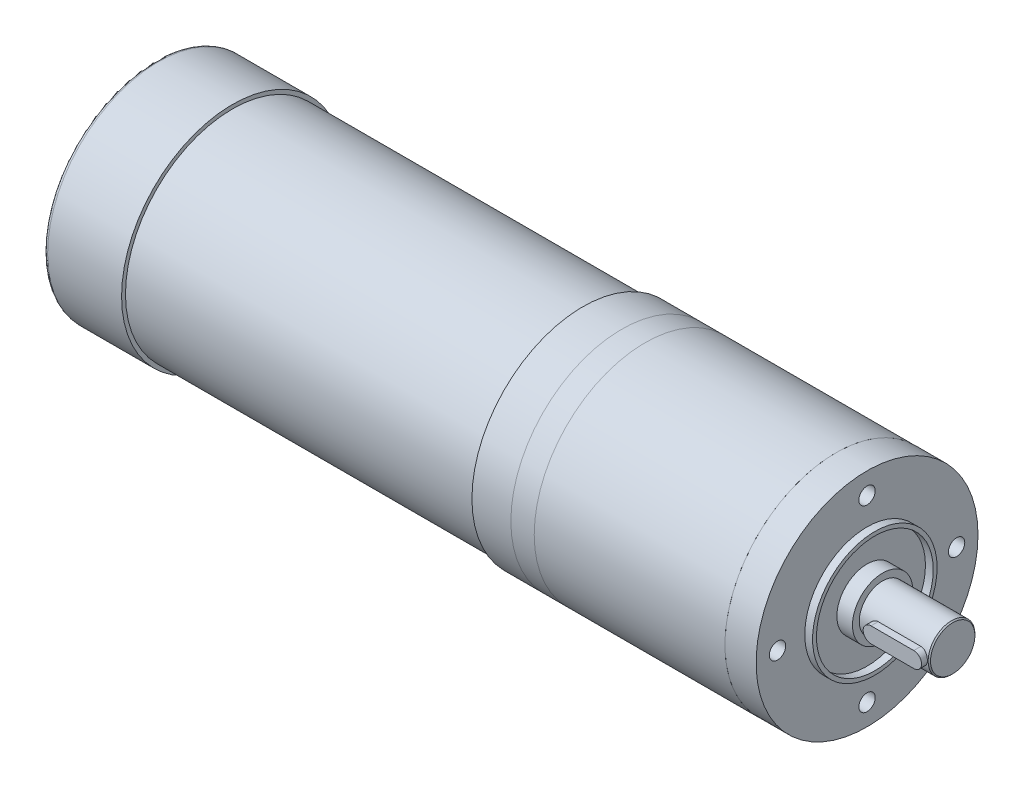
ISO-10303-21;
HEADER;
FILE_DESCRIPTION(('STEP AP214'),'2;1');
FILE_NAME('part.step','',(''),(''),'','','');
FILE_SCHEMA(('AUTOMOTIVE_DESIGN { 1 0 10303 214 1 1 1 1 }'));
ENDSEC;
DATA;
#1=APPLICATION_CONTEXT('core data for automotive mechanical design processes');
#2=APPLICATION_PROTOCOL_DEFINITION('international standard','automotive_design',2000,#1);
#3=PRODUCT_CONTEXT('',#1,'mechanical');
#4=PRODUCT('Part','Part','',(#3));
#5=PRODUCT_RELATED_PRODUCT_CATEGORY('part','',(#4));
#6=PRODUCT_DEFINITION_FORMATION('','',#4);
#7=PRODUCT_DEFINITION_CONTEXT('part definition',#1,'design');
#8=PRODUCT_DEFINITION('design','',#6,#7);
#9=PRODUCT_DEFINITION_SHAPE('','',#8);
#10=(LENGTH_UNIT() NAMED_UNIT(*) SI_UNIT(.MILLI.,.METRE.));
#11=(NAMED_UNIT(*) PLANE_ANGLE_UNIT() SI_UNIT($,.RADIAN.));
#12=(NAMED_UNIT(*) SI_UNIT($,.STERADIAN.) SOLID_ANGLE_UNIT());
#13=UNCERTAINTY_MEASURE_WITH_UNIT(LENGTH_MEASURE(1.E-05),#10,'distance_accuracy_value','');
#14=(GEOMETRIC_REPRESENTATION_CONTEXT(3) GLOBAL_UNCERTAINTY_ASSIGNED_CONTEXT((#13)) GLOBAL_UNIT_ASSIGNED_CONTEXT((#10,
#11,#12)) REPRESENTATION_CONTEXT('',''));
#15=CARTESIAN_POINT('',(0.,0.,0.));
#16=DIRECTION('',(0.,0.,1.));
#17=DIRECTION('',(1.,0.,0.));
#18=AXIS2_PLACEMENT_3D('',#15,#16,#17);
#19=CARTESIAN_POINT('',(8.5,0.,7.5));
#20=DIRECTION('',(0.,0.,-1.));
#21=DIRECTION('',(-1.,0.,0.));
#22=AXIS2_PLACEMENT_3D('',#19,#20,#21);
#23=CYLINDRICAL_SURFACE('',#22,2.);
#24=CARTESIAN_POINT('',(8.5,0.,3.5));
#25=DIRECTION('',(0.,0.,1.));
#26=DIRECTION('',(1.,0.,0.));
#27=AXIS2_PLACEMENT_3D('',#24,#25,#26);
#28=CIRCLE('',#27,2.);
#29=CARTESIAN_POINT('',(8.5,2.,3.5));
#30=VERTEX_POINT('',#29);
#31=CARTESIAN_POINT('',(8.5,-2.,3.5));
#32=VERTEX_POINT('',#31);
#33=EDGE_CURVE('E111',#30,#32,#28,.T.);
#34=ORIENTED_EDGE('',*,*,#33,.T.);
#35=DIRECTION('',(0.,0.,-1.));
#36=VECTOR('',#35,1.);
#37=CARTESIAN_POINT('',(8.5,-2.,7.5));
#38=LINE('',#37,#36);
#39=CARTESIAN_POINT('',(8.5,-2.,7.5));
#40=VERTEX_POINT('',#39);
#41=EDGE_CURVE('E12',#40,#32,#38,.T.);
#42=ORIENTED_EDGE('',*,*,#41,.F.);
#43=CARTESIAN_POINT('',(8.5,0.,7.5));
#44=DIRECTION('',(0.,0.,1.));
#45=DIRECTION('',(1.,0.,0.));
#46=AXIS2_PLACEMENT_3D('',#43,#44,#45);
#47=CIRCLE('',#46,2.);
#48=CARTESIAN_POINT('',(8.5,2.,7.5));
#49=VERTEX_POINT('',#48);
#50=EDGE_CURVE('E99',#49,#40,#47,.T.);
#51=ORIENTED_EDGE('',*,*,#50,.F.);
#52=DIRECTION('',(0.,0.,-1.));
#53=VECTOR('',#52,1.);
#54=CARTESIAN_POINT('',(8.5,2.,7.5));
#55=LINE('',#54,#53);
#56=EDGE_CURVE('E107',#49,#30,#55,.T.);
#57=ORIENTED_EDGE('',*,*,#56,.T.);
#58=EDGE_LOOP('',(#34,#42,#51,#57));
#59=FACE_BOUND('',#58,.T.);
#60=ADVANCED_FACE('F48',(#59),#23,.T.);
#61=CARTESIAN_POINT('',(19.5,-2.,7.5));
#62=DIRECTION('',(0.,1.,0.));
#63=DIRECTION('',(-1.,0.,0.));
#64=AXIS2_PLACEMENT_3D('',#61,#62,#63);
#65=PLANE('',#64);
#66=DIRECTION('',(1.,0.,0.));
#67=VECTOR('',#66,1.);
#68=CARTESIAN_POINT('',(19.5,-2.,3.5));
#69=LINE('',#68,#67);
#70=CARTESIAN_POINT('',(19.5,-2.,3.5));
#71=VERTEX_POINT('',#70);
#72=EDGE_CURVE('E103',#32,#71,#69,.T.);
#73=ORIENTED_EDGE('',*,*,#72,.T.);
#74=DIRECTION('',(0.,0.,-1.));
#75=VECTOR('',#74,1.);
#76=CARTESIAN_POINT('',(19.5,-2.,7.5));
#77=LINE('',#76,#75);
#78=CARTESIAN_POINT('',(19.5,-2.,7.5));
#79=VERTEX_POINT('',#78);
#80=EDGE_CURVE('E56',#79,#71,#77,.T.);
#81=ORIENTED_EDGE('',*,*,#80,.F.);
#82=DIRECTION('',(1.,0.,0.));
#83=VECTOR('',#82,1.);
#84=CARTESIAN_POINT('',(19.5,-2.,7.5));
#85=LINE('',#84,#83);
#86=EDGE_CURVE('E94',#40,#79,#85,.T.);
#87=ORIENTED_EDGE('',*,*,#86,.F.);
#88=ORIENTED_EDGE('',*,*,#41,.T.);
#89=EDGE_LOOP('',(#73,#81,#87,#88));
#90=FACE_BOUND('',#89,.T.);
#91=ADVANCED_FACE('F102',(#90),#65,.F.);
#92=CARTESIAN_POINT('',(19.5,0.,7.5));
#93=DIRECTION('',(0.,0.,-1.));
#94=DIRECTION('',(-1.,0.,0.));
#95=AXIS2_PLACEMENT_3D('',#92,#93,#94);
#96=CYLINDRICAL_SURFACE('',#95,2.);
#97=CARTESIAN_POINT('',(19.5,0.,3.5));
#98=DIRECTION('',(0.,0.,1.));
#99=DIRECTION('',(1.,0.,0.));
#100=AXIS2_PLACEMENT_3D('',#97,#98,#99);
#101=CIRCLE('',#100,2.);
#102=CARTESIAN_POINT('',(19.5,2.,3.5));
#103=VERTEX_POINT('',#102);
#104=EDGE_CURVE('E81',#71,#103,#101,.T.);
#105=ORIENTED_EDGE('',*,*,#104,.T.);
#106=DIRECTION('',(0.,0.,-1.));
#107=VECTOR('',#106,1.);
#108=CARTESIAN_POINT('',(19.5,2.,7.5));
#109=LINE('',#108,#107);
#110=CARTESIAN_POINT('',(19.5,2.,7.5));
#111=VERTEX_POINT('',#110);
#112=EDGE_CURVE('E104',#111,#103,#109,.T.);
#113=ORIENTED_EDGE('',*,*,#112,.F.);
#114=CARTESIAN_POINT('',(19.5,0.,7.5));
#115=DIRECTION('',(0.,0.,1.));
#116=DIRECTION('',(1.,0.,0.));
#117=AXIS2_PLACEMENT_3D('',#114,#115,#116);
#118=CIRCLE('',#117,2.);
#119=EDGE_CURVE('E97',#79,#111,#118,.T.);
#120=ORIENTED_EDGE('',*,*,#119,.F.);
#121=ORIENTED_EDGE('',*,*,#80,.T.);
#122=EDGE_LOOP('',(#105,#113,#120,#121));
#123=FACE_BOUND('',#122,.T.);
#124=ADVANCED_FACE('F105',(#123),#96,.T.);
#125=CARTESIAN_POINT('',(8.5,2.,7.5));
#126=DIRECTION('',(0.,-1.,0.));
#127=DIRECTION('',(1.,0.,0.));
#128=AXIS2_PLACEMENT_3D('',#125,#126,#127);
#129=PLANE('',#128);
#130=DIRECTION('',(-1.,0.,0.));
#131=VECTOR('',#130,1.);
#132=CARTESIAN_POINT('',(8.5,2.,3.5));
#133=LINE('',#132,#131);
#134=EDGE_CURVE('E87',#103,#30,#133,.T.);
#135=ORIENTED_EDGE('',*,*,#134,.T.);
#136=ORIENTED_EDGE('',*,*,#56,.F.);
#137=DIRECTION('',(-1.,0.,0.));
#138=VECTOR('',#137,1.);
#139=CARTESIAN_POINT('',(8.5,2.,7.5));
#140=LINE('',#139,#138);
#141=EDGE_CURVE('E64',#111,#49,#140,.T.);
#142=ORIENTED_EDGE('',*,*,#141,.F.);
#143=ORIENTED_EDGE('',*,*,#112,.T.);
#144=EDGE_LOOP('',(#135,#136,#142,#143));
#145=FACE_BOUND('',#144,.T.);
#146=ADVANCED_FACE('F118',(#145),#129,.F.);
#147=CARTESIAN_POINT('',(8.5,0.,7.5));
#148=DIRECTION('',(0.,0.,1.));
#149=DIRECTION('',(1.,0.,0.));
#150=AXIS2_PLACEMENT_3D('',#147,#148,#149);
#151=PLANE('',#150);
#152=ORIENTED_EDGE('',*,*,#50,.T.);
#153=ORIENTED_EDGE('',*,*,#86,.T.);
#154=ORIENTED_EDGE('',*,*,#119,.T.);
#155=ORIENTED_EDGE('',*,*,#141,.T.);
#156=EDGE_LOOP('',(#152,#153,#154,#155));
#157=FACE_BOUND('',#156,.T.);
#158=ADVANCED_FACE('F95',(#157),#151,.T.);
#159=CARTESIAN_POINT('',(8.5,0.,3.5));
#160=DIRECTION('',(0.,0.,1.));
#161=DIRECTION('',(1.,0.,0.));
#162=AXIS2_PLACEMENT_3D('',#159,#160,#161);
#163=PLANE('',#162);
#164=ORIENTED_EDGE('',*,*,#33,.F.);
#165=ORIENTED_EDGE('',*,*,#134,.F.);
#166=ORIENTED_EDGE('',*,*,#104,.F.);
#167=ORIENTED_EDGE('',*,*,#72,.F.);
#168=EDGE_LOOP('',(#164,#165,#166,#167));
#169=FACE_BOUND('',#168,.T.);
#170=ADVANCED_FACE('F121',(#169),#163,.F.);
#171=CLOSED_SHELL('',(#60,#91,#124,#146,#158,#170));
#172=MANIFOLD_SOLID_BREP('B2',#171);
#173=CARTESIAN_POINT('',(-73.,0.,0.));
#174=DIRECTION('',(-1.,0.,0.));
#175=DIRECTION('',(0.,0.,1.));
#176=AXIS2_PLACEMENT_3D('',#173,#174,#175);
#177=PLANE('',#176);
#178=CARTESIAN_POINT('',(-73.,0.,0.));
#179=DIRECTION('',(-1.,0.,0.));
#180=DIRECTION('',(0.,0.,1.));
#181=AXIS2_PLACEMENT_3D('',#178,#179,#180);
#182=CIRCLE('',#181,28.5);
#183=CARTESIAN_POINT('',(-73.,0.,28.5));
#184=VERTEX_POINT('',#183);
#185=EDGE_CURVE('E191',#184,#184,#182,.T.);
#186=ORIENTED_EDGE('',*,*,#185,.T.);
#187=EDGE_LOOP('',(#186));
#188=FACE_BOUND('',#187,.T.);
#189=CARTESIAN_POINT('',(-73.,0.,0.));
#190=DIRECTION('',(-1.,0.,0.));
#191=DIRECTION('',(0.,0.,1.));
#192=AXIS2_PLACEMENT_3D('',#189,#190,#191);
#193=CIRCLE('',#192,27.5);
#194=CARTESIAN_POINT('',(-73.,0.,-27.5));
#195=VERTEX_POINT('',#194);
#196=EDGE_CURVE('E201',#195,#195,#193,.T.);
#197=ORIENTED_EDGE('',*,*,#196,.F.);
#198=EDGE_LOOP('',(#197));
#199=FACE_BOUND('',#198,.T.);
#200=ADVANCED_FACE('F180',(#188,#199),#177,.T.);
#201=CARTESIAN_POINT('',(-73.,0.,0.));
#202=DIRECTION('',(1.,0.,0.));
#203=DIRECTION('',(0.,0.,-1.));
#204=AXIS2_PLACEMENT_3D('',#201,#202,#203);
#205=CYLINDRICAL_SURFACE('',#204,28.5);
#206=ORIENTED_EDGE('',*,*,#185,.F.);
#207=EDGE_LOOP('',(#206));
#208=FACE_BOUND('',#207,.T.);
#209=CARTESIAN_POINT('',(-63.,0.,0.));
#210=DIRECTION('',(-1.,0.,0.));
#211=DIRECTION('',(0.,0.,1.));
#212=AXIS2_PLACEMENT_3D('',#209,#210,#211);
#213=CIRCLE('',#212,28.5);
#214=CARTESIAN_POINT('',(-63.,0.,28.5));
#215=VERTEX_POINT('',#214);
#216=EDGE_CURVE('E195',#215,#215,#213,.T.);
#217=ORIENTED_EDGE('',*,*,#216,.T.);
#218=EDGE_LOOP('',(#217));
#219=FACE_BOUND('',#218,.T.);
#220=ADVANCED_FACE('F226',(#208,#219),#205,.T.);
#221=CARTESIAN_POINT('',(-63.,0.,0.));
#222=DIRECTION('',(-1.,0.,0.));
#223=DIRECTION('',(0.,0.,1.));
#224=AXIS2_PLACEMENT_3D('',#221,#222,#223);
#225=PLANE('',#224);
#226=ORIENTED_EDGE('',*,*,#216,.F.);
#227=EDGE_LOOP('',(#226));
#228=FACE_BOUND('',#227,.T.);
#229=ADVANCED_FACE('F221',(#228),#225,.F.);
#230=CARTESIAN_POINT('',(-163.,0.,0.));
#231=DIRECTION('',(1.,0.,0.));
#232=DIRECTION('',(0.,0.,-1.));
#233=AXIS2_PLACEMENT_3D('',#230,#231,#232);
#234=CYLINDRICAL_SURFACE('',#233,27.5);
#235=CARTESIAN_POINT('',(-163.,0.,0.));
#236=DIRECTION('',(-1.,0.,0.));
#237=DIRECTION('',(0.,0.,1.));
#238=AXIS2_PLACEMENT_3D('',#235,#236,#237);
#239=CIRCLE('',#238,27.5);
#240=CARTESIAN_POINT('',(-163.,0.,-27.5));
#241=VERTEX_POINT('',#240);
#242=EDGE_CURVE('E199',#241,#241,#239,.T.);
#243=CARTESIAN_POINT('',(-163.,0.,-27.5));
#244=CARTESIAN_POINT('',(-162.0625,0.,-27.5));
#245=CARTESIAN_POINT('',(-161.125,0.,-27.5));
#246=CARTESIAN_POINT('',(-159.25,0.,-27.5));
#247=CARTESIAN_POINT('',(-158.3125,0.,-27.5));
#248=CARTESIAN_POINT('',(-156.4375,0.,-27.5));
#249=CARTESIAN_POINT('',(-155.5,0.,-27.5));
#250=CARTESIAN_POINT('',(-153.625,0.,-27.5));
#251=CARTESIAN_POINT('',(-152.6875,0.,-27.5));
#252=CARTESIAN_POINT('',(-150.8125,0.,-27.5));
#253=CARTESIAN_POINT('',(-149.875,0.,-27.5));
#254=CARTESIAN_POINT('',(-148.,0.,-27.5));
#255=CARTESIAN_POINT('',(-147.0625,0.,-27.5));
#256=CARTESIAN_POINT('',(-145.1875,0.,-27.5));
#257=CARTESIAN_POINT('',(-144.25,0.,-27.5));
#258=CARTESIAN_POINT('',(-142.375,0.,-27.5));
#259=CARTESIAN_POINT('',(-141.4375,0.,-27.5));
#260=CARTESIAN_POINT('',(-139.5625,0.,-27.5));
#261=CARTESIAN_POINT('',(-138.625,0.,-27.5));
#262=CARTESIAN_POINT('',(-136.75,0.,-27.5));
#263=CARTESIAN_POINT('',(-135.8125,0.,-27.5));
#264=CARTESIAN_POINT('',(-133.9375,0.,-27.5));
#265=CARTESIAN_POINT('',(-133.,0.,-27.5));
#266=CARTESIAN_POINT('',(-131.125,0.,-27.5));
#267=CARTESIAN_POINT('',(-130.1875,0.,-27.5));
#268=CARTESIAN_POINT('',(-128.3125,0.,-27.5));
#269=CARTESIAN_POINT('',(-127.375,0.,-27.5));
#270=CARTESIAN_POINT('',(-125.5,0.,-27.5));
#271=CARTESIAN_POINT('',(-124.5625,0.,-27.5));
#272=CARTESIAN_POINT('',(-122.6875,0.,-27.5));
#273=CARTESIAN_POINT('',(-121.75,0.,-27.5));
#274=CARTESIAN_POINT('',(-119.875,0.,-27.5));
#275=CARTESIAN_POINT('',(-118.9375,0.,-27.5));
#276=CARTESIAN_POINT('',(-117.0625,0.,-27.5));
#277=CARTESIAN_POINT('',(-116.125,0.,-27.5));
#278=CARTESIAN_POINT('',(-114.25,0.,-27.5));
#279=CARTESIAN_POINT('',(-113.3125,0.,-27.5));
#280=CARTESIAN_POINT('',(-111.4375,0.,-27.5));
#281=CARTESIAN_POINT('',(-110.5,0.,-27.5));
#282=CARTESIAN_POINT('',(-108.625,0.,-27.5));
#283=CARTESIAN_POINT('',(-107.6875,0.,-27.5));
#284=CARTESIAN_POINT('',(-105.8125,0.,-27.5));
#285=CARTESIAN_POINT('',(-104.875,0.,-27.5));
#286=CARTESIAN_POINT('',(-103.,0.,-27.5));
#287=CARTESIAN_POINT('',(-102.0625,0.,-27.5));
#288=CARTESIAN_POINT('',(-100.1875,0.,-27.5));
#289=CARTESIAN_POINT('',(-99.25,0.,-27.5));
#290=CARTESIAN_POINT('',(-97.375,0.,-27.5));
#291=CARTESIAN_POINT('',(-96.4375,0.,-27.5));
#292=CARTESIAN_POINT('',(-94.5625,0.,-27.5));
#293=CARTESIAN_POINT('',(-93.625,0.,-27.5));
#294=CARTESIAN_POINT('',(-91.75,0.,-27.5));
#295=CARTESIAN_POINT('',(-90.8125,0.,-27.5));
#296=CARTESIAN_POINT('',(-88.9375,0.,-27.5));
#297=CARTESIAN_POINT('',(-88.,0.,-27.5));
#298=CARTESIAN_POINT('',(-86.125,0.,-27.5));
#299=CARTESIAN_POINT('',(-85.1875,0.,-27.5));
#300=CARTESIAN_POINT('',(-83.3125,0.,-27.5));
#301=CARTESIAN_POINT('',(-82.375,0.,-27.5));
#302=CARTESIAN_POINT('',(-80.5,0.,-27.5));
#303=CARTESIAN_POINT('',(-79.5625,0.,-27.5));
#304=CARTESIAN_POINT('',(-77.6875,0.,-27.5));
#305=CARTESIAN_POINT('',(-76.75,0.,-27.5));
#306=CARTESIAN_POINT('',(-74.875,0.,-27.5));
#307=CARTESIAN_POINT('',(-73.9375,0.,-27.5));
#308=CARTESIAN_POINT('',(-73.,0.,-27.5));
#309=B_SPLINE_CURVE_WITH_KNOTS('',3,(#243,#244,#245,#246,#247,#248,#249,#250,#251,#252,#253,
#254,#255,#256,#257,#258,#259,#260,#261,#262,#263,#264,#265,#266,#267,#268,#269,#270,#271,#272,
#273,#274,#275,#276,#277,#278,#279,#280,#281,#282,#283,#284,#285,#286,#287,#288,#289,#290,#291,
#292,#293,#294,#295,#296,#297,#298,#299,#300,#301,#302,#303,#304,#305,#306,#307,#308),
.UNSPECIFIED.,.F.,.F.,(4,2,2,2,2,2,2,2,2,2,2,2,2,2,2,2,2,2,2,2,2,2,2,2,2,2,2,2,2,2,2,2,4),(0.,
2.8125,5.62499999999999,8.43749999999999,11.25,14.0625,16.875,19.6875,22.5,25.3125,28.125,
30.9375,33.75,36.5625,39.375,42.1875,45.,47.8125,50.625,53.4375,56.25,59.0625,61.875,64.6875,
67.5,70.3125,73.125,75.9375,78.75,81.5625,84.3749999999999,87.1875,90.),.UNSPECIFIED.);
#310=EDGE_CURVE('BSEAM215',#241,#195,#309,.T.);
#311=ORIENTED_EDGE('',*,*,#242,.F.);
#312=ORIENTED_EDGE('',*,*,#196,.T.);
#313=ORIENTED_EDGE('',*,*,#310,.T.);
#314=ORIENTED_EDGE('',*,*,#310,.F.);
#315=EDGE_LOOP('',(#311,#313,#312,#314));
#316=FACE_BOUND('',#315,.T.);
#317=ADVANCED_FACE('F215',(#316),#234,.T.);
#318=CARTESIAN_POINT('',(-163.,0.,0.));
#319=DIRECTION('',(-1.,0.,0.));
#320=DIRECTION('',(0.,0.,1.));
#321=AXIS2_PLACEMENT_3D('',#318,#319,#320);
#322=PLANE('',#321);
#323=CARTESIAN_POINT('',(-163.,0.,0.));
#324=DIRECTION('',(-1.,0.,0.));
#325=DIRECTION('',(0.,0.,1.));
#326=AXIS2_PLACEMENT_3D('',#323,#324,#325);
#327=CIRCLE('',#326,28.5);
#328=CARTESIAN_POINT('',(-163.,0.,28.5));
#329=VERTEX_POINT('',#328);
#330=EDGE_CURVE('E204',#329,#329,#327,.T.);
#331=ORIENTED_EDGE('',*,*,#330,.F.);
#332=EDGE_LOOP('',(#331));
#333=FACE_BOUND('',#332,.T.);
#334=ORIENTED_EDGE('',*,*,#242,.T.);
#335=EDGE_LOOP('',(#334));
#336=FACE_BOUND('',#335,.T.);
#337=ADVANCED_FACE('F212',(#333,#336),#322,.F.);
#338=CARTESIAN_POINT('',(-183.,0.,0.));
#339=DIRECTION('',(1.,0.,0.));
#340=DIRECTION('',(0.,0.,-1.));
#341=AXIS2_PLACEMENT_3D('',#338,#339,#340);
#342=CYLINDRICAL_SURFACE('',#341,28.5);
#343=CARTESIAN_POINT('',(-182.,0.,0.));
#344=DIRECTION('',(-1.,0.,0.));
#345=DIRECTION('',(0.,0.,1.));
#346=AXIS2_PLACEMENT_3D('',#343,#344,#345);
#347=CIRCLE('',#346,28.5);
#348=CARTESIAN_POINT('',(-182.,0.,28.5));
#349=VERTEX_POINT('',#348);
#350=EDGE_CURVE('E47',#349,#349,#347,.F.);
#351=ORIENTED_EDGE('',*,*,#350,.T.);
#352=EDGE_LOOP('',(#351));
#353=FACE_BOUND('',#352,.T.);
#354=ORIENTED_EDGE('',*,*,#330,.T.);
#355=EDGE_LOOP('',(#354));
#356=FACE_BOUND('',#355,.T.);
#357=ADVANCED_FACE('F210',(#353,#356),#342,.T.);
#358=CARTESIAN_POINT('',(-183.,0.,0.));
#359=DIRECTION('',(-1.,0.,0.));
#360=DIRECTION('',(0.,0.,1.));
#361=AXIS2_PLACEMENT_3D('',#358,#359,#360);
#362=PLANE('',#361);
#363=CARTESIAN_POINT('',(-183.,0.,0.));
#364=DIRECTION('',(-1.,0.,0.));
#365=DIRECTION('',(0.,0.,1.));
#366=AXIS2_PLACEMENT_3D('',#363,#364,#365);
#367=CIRCLE('',#366,27.5);
#368=CARTESIAN_POINT('',(-183.,0.,27.5));
#369=VERTEX_POINT('',#368);
#370=EDGE_CURVE('E187',#369,#369,#367,.T.);
#371=ORIENTED_EDGE('',*,*,#370,.T.);
#372=EDGE_LOOP('',(#371));
#373=FACE_BOUND('',#372,.T.);
#374=ADVANCED_FACE('F257',(#373),#362,.T.);
#375=CARTESIAN_POINT('',(-182.,0.,0.));
#376=DIRECTION('',(-1.,0.,0.));
#377=DIRECTION('',(0.,0.,1.));
#378=AXIS2_PLACEMENT_3D('',#375,#376,#377);
#379=TOROIDAL_SURFACE('',#378,27.5,1.);
#380=ORIENTED_EDGE('',*,*,#350,.F.);
#381=EDGE_LOOP('',(#380));
#382=FACE_BOUND('',#381,.T.);
#383=ORIENTED_EDGE('',*,*,#370,.F.);
#384=EDGE_LOOP('',(#383));
#385=FACE_BOUND('',#384,.T.);
#386=ADVANCED_FACE('F182',(#382,#385),#379,.T.);
#387=CLOSED_SHELL('',(#200,#220,#229,#317,#337,#357,#374,#386));
#388=MANIFOLD_SOLID_BREP('B6',#387);
#389=CARTESIAN_POINT('',(-63.,0.,0.));
#390=DIRECTION('',(1.,0.,0.));
#391=DIRECTION('',(0.,0.,-1.));
#392=AXIS2_PLACEMENT_3D('',#389,#390,#391);
#393=CYLINDRICAL_SURFACE('',#392,28.5);
#394=CARTESIAN_POINT('',(-63.,0.,0.));
#395=DIRECTION('',(-1.,0.,0.));
#396=DIRECTION('',(0.,0.,1.));
#397=AXIS2_PLACEMENT_3D('',#394,#395,#396);
#398=CIRCLE('',#397,28.5);
#399=CARTESIAN_POINT('',(-63.,0.,28.5));
#400=VERTEX_POINT('',#399);
#401=EDGE_CURVE('E179',#400,#400,#398,.T.);
#402=ORIENTED_EDGE('',*,*,#401,.F.);
#403=EDGE_LOOP('',(#402));
#404=FACE_BOUND('',#403,.T.);
#405=CARTESIAN_POINT('',(-57.,0.,0.));
#406=DIRECTION('',(-1.,0.,0.));
#407=DIRECTION('',(0.,0.,1.));
#408=AXIS2_PLACEMENT_3D('',#405,#406,#407);
#409=CIRCLE('',#408,28.5);
#410=CARTESIAN_POINT('',(-57.,0.,28.5));
#411=VERTEX_POINT('',#410);
#412=EDGE_CURVE('E309',#411,#411,#409,.T.);
#413=ORIENTED_EDGE('',*,*,#412,.T.);
#414=EDGE_LOOP('',(#413));
#415=FACE_BOUND('',#414,.T.);
#416=ADVANCED_FACE('F306',(#404,#415),#393,.T.);
#417=CARTESIAN_POINT('',(-63.,0.,0.));
#418=DIRECTION('',(-1.,0.,0.));
#419=DIRECTION('',(0.,0.,1.));
#420=AXIS2_PLACEMENT_3D('',#417,#418,#419);
#421=PLANE('',#420);
#422=ORIENTED_EDGE('',*,*,#401,.T.);
#423=EDGE_LOOP('',(#422));
#424=FACE_BOUND('',#423,.T.);
#425=ADVANCED_FACE('F321',(#424),#421,.T.);
#426=CARTESIAN_POINT('',(-57.,0.,0.));
#427=DIRECTION('',(-1.,0.,0.));
#428=DIRECTION('',(0.,0.,1.));
#429=AXIS2_PLACEMENT_3D('',#426,#427,#428);
#430=PLANE('',#429);
#431=ORIENTED_EDGE('',*,*,#412,.F.);
#432=EDGE_LOOP('',(#431));
#433=FACE_BOUND('',#432,.T.);
#434=ADVANCED_FACE('F319',(#433),#430,.F.);
#435=CLOSED_SHELL('',(#416,#425,#434));
#436=MANIFOLD_SOLID_BREP('B42',#435);
#437=CARTESIAN_POINT('',(-57.,0.,0.));
#438=DIRECTION('',(1.,0.,0.));
#439=DIRECTION('',(0.,0.,-1.));
#440=AXIS2_PLACEMENT_3D('',#437,#438,#439);
#441=CYLINDRICAL_SURFACE('',#440,28.5);
#442=CARTESIAN_POINT('',(-57.,0.,0.));
#443=DIRECTION('',(-1.,0.,0.));
#444=DIRECTION('',(0.,0.,1.));
#445=AXIS2_PLACEMENT_3D('',#442,#443,#444);
#446=CIRCLE('',#445,28.5);
#447=CARTESIAN_POINT('',(-57.,0.,28.5));
#448=VERTEX_POINT('',#447);
#449=EDGE_CURVE('E304',#448,#448,#446,.T.);
#450=ORIENTED_EDGE('',*,*,#449,.F.);
#451=EDGE_LOOP('',(#450));
#452=FACE_BOUND('',#451,.T.);
#453=CARTESIAN_POINT('',(-8.,0.,0.));
#454=DIRECTION('',(-1.,0.,0.));
#455=DIRECTION('',(0.,0.,1.));
#456=AXIS2_PLACEMENT_3D('',#453,#454,#455);
#457=CIRCLE('',#456,28.5);
#458=CARTESIAN_POINT('',(-8.,0.,28.5));
#459=VERTEX_POINT('',#458);
#460=EDGE_CURVE('E364',#459,#459,#457,.T.);
#461=ORIENTED_EDGE('',*,*,#460,.T.);
#462=EDGE_LOOP('',(#461));
#463=FACE_BOUND('',#462,.T.);
#464=ADVANCED_FACE('F356',(#452,#463),#441,.T.);
#465=CARTESIAN_POINT('',(-57.,0.,0.));
#466=DIRECTION('',(-1.,0.,0.));
#467=DIRECTION('',(0.,0.,1.));
#468=AXIS2_PLACEMENT_3D('',#465,#466,#467);
#469=PLANE('',#468);
#470=ORIENTED_EDGE('',*,*,#449,.T.);
#471=EDGE_LOOP('',(#470));
#472=FACE_BOUND('',#471,.T.);
#473=ADVANCED_FACE('F429',(#472),#469,.T.);
#474=CARTESIAN_POINT('',(-8.,0.,0.));
#475=DIRECTION('',(-1.,0.,0.));
#476=DIRECTION('',(0.,0.,1.));
#477=AXIS2_PLACEMENT_3D('',#474,#475,#476);
#478=PLANE('',#477);
#479=CARTESIAN_POINT('',(-8.,23.,0.));
#480=DIRECTION('',(-1.,0.,0.));
#481=DIRECTION('',(0.,0.,1.));
#482=AXIS2_PLACEMENT_3D('',#479,#480,#481);
#483=CIRCLE('',#482,2.1);
#484=CARTESIAN_POINT('',(-8.,23.,2.1));
#485=VERTEX_POINT('',#484);
#486=EDGE_CURVE('E359',#485,#485,#483,.T.);
#487=ORIENTED_EDGE('',*,*,#486,.T.);
#488=EDGE_LOOP('',(#487));
#489=FACE_BOUND('',#488,.T.);
#490=CARTESIAN_POINT('',(-8.,0.,-23.));
#491=DIRECTION('',(-1.,0.,0.));
#492=DIRECTION('',(0.,0.,1.));
#493=AXIS2_PLACEMENT_3D('',#490,#491,#492);
#494=CIRCLE('',#493,2.1);
#495=CARTESIAN_POINT('',(-8.,0.,-20.9));
#496=VERTEX_POINT('',#495);
#497=EDGE_CURVE('E393',#496,#496,#494,.T.);
#498=ORIENTED_EDGE('',*,*,#497,.T.);
#499=EDGE_LOOP('',(#498));
#500=FACE_BOUND('',#499,.T.);
#501=CARTESIAN_POINT('',(-8.,-23.,0.));
#502=DIRECTION('',(-1.,0.,0.));
#503=DIRECTION('',(0.,0.,1.));
#504=AXIS2_PLACEMENT_3D('',#501,#502,#503);
#505=CIRCLE('',#504,2.1);
#506=CARTESIAN_POINT('',(-8.,-23.,2.1));
#507=VERTEX_POINT('',#506);
#508=EDGE_CURVE('E397',#507,#507,#505,.T.);
#509=ORIENTED_EDGE('',*,*,#508,.T.);
#510=EDGE_LOOP('',(#509));
#511=FACE_BOUND('',#510,.T.);
#512=CARTESIAN_POINT('',(-8.,0.,23.));
#513=DIRECTION('',(-1.,0.,0.));
#514=DIRECTION('',(0.,0.,1.));
#515=AXIS2_PLACEMENT_3D('',#512,#513,#514);
#516=CIRCLE('',#515,2.1);
#517=CARTESIAN_POINT('',(-8.,0.,25.1));
#518=VERTEX_POINT('',#517);
#519=EDGE_CURVE('E400',#518,#518,#516,.T.);
#520=ORIENTED_EDGE('',*,*,#519,.T.);
#521=EDGE_LOOP('',(#520));
#522=FACE_BOUND('',#521,.T.);
#523=ORIENTED_EDGE('',*,*,#460,.F.);
#524=EDGE_LOOP('',(#523));
#525=FACE_BOUND('',#524,.T.);
#526=ADVANCED_FACE('F410',(#489,#500,#511,#522,#525),#478,.F.);
#527=CARTESIAN_POINT('',(0.,0.,23.));
#528=DIRECTION('',(1.,0.,0.));
#529=DIRECTION('',(0.,0.,-1.));
#530=AXIS2_PLACEMENT_3D('',#527,#528,#529);
#531=CYLINDRICAL_SURFACE('',#530,2.1);
#532=CARTESIAN_POINT('',(-14.,0.,23.));
#533=DIRECTION('',(1.,0.,0.));
#534=DIRECTION('',(0.,0.,-1.));
#535=AXIS2_PLACEMENT_3D('',#532,#533,#534);
#536=CIRCLE('',#535,2.1);
#537=CARTESIAN_POINT('',(-14.,0.,20.9));
#538=VERTEX_POINT('',#537);
#539=EDGE_CURVE('E398',#538,#538,#536,.T.);
#540=ORIENTED_EDGE('',*,*,#539,.F.);
#541=EDGE_LOOP('',(#540));
#542=FACE_BOUND('',#541,.T.);
#543=ORIENTED_EDGE('',*,*,#519,.F.);
#544=EDGE_LOOP('',(#543));
#545=FACE_BOUND('',#544,.T.);
#546=ADVANCED_FACE('F441',(#542,#545),#531,.F.);
#547=CARTESIAN_POINT('',(-14.,0.,23.));
#548=DIRECTION('',(1.,0.,0.));
#549=DIRECTION('',(0.,0.,-1.));
#550=AXIS2_PLACEMENT_3D('',#547,#548,#549);
#551=CONICAL_SURFACE('',#550,2.1,1.02974425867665);
#552=CARTESIAN_POINT('',(-15.2618072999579,0.,23.));
#553=VERTEX_POINT('',#552);
#554=VERTEX_LOOP('',#553);
#555=FACE_BOUND('',#554,.T.);
#556=ORIENTED_EDGE('',*,*,#539,.T.);
#557=EDGE_LOOP('',(#556));
#558=FACE_BOUND('',#557,.T.);
#559=ADVANCED_FACE('F446',(#555,#558),#551,.F.);
#560=CARTESIAN_POINT('',(0.,-23.,0.));
#561=DIRECTION('',(1.,0.,0.));
#562=DIRECTION('',(0.,0.,-1.));
#563=AXIS2_PLACEMENT_3D('',#560,#561,#562);
#564=CYLINDRICAL_SURFACE('',#563,2.1);
#565=CARTESIAN_POINT('',(-14.,-23.,0.));
#566=DIRECTION('',(1.,0.,0.));
#567=DIRECTION('',(0.,0.,-1.));
#568=AXIS2_PLACEMENT_3D('',#565,#566,#567);
#569=CIRCLE('',#568,2.1);
#570=CARTESIAN_POINT('',(-14.,-23.,-2.1));
#571=VERTEX_POINT('',#570);
#572=EDGE_CURVE('E394',#571,#571,#569,.T.);
#573=ORIENTED_EDGE('',*,*,#572,.F.);
#574=EDGE_LOOP('',(#573));
#575=FACE_BOUND('',#574,.T.);
#576=ORIENTED_EDGE('',*,*,#508,.F.);
#577=EDGE_LOOP('',(#576));
#578=FACE_BOUND('',#577,.T.);
#579=ADVANCED_FACE('F425',(#575,#578),#564,.F.);
#580=CARTESIAN_POINT('',(-14.,-23.,0.));
#581=DIRECTION('',(1.,0.,0.));
#582=DIRECTION('',(0.,0.,-1.));
#583=AXIS2_PLACEMENT_3D('',#580,#581,#582);
#584=CONICAL_SURFACE('',#583,2.1,1.02974425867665);
#585=CARTESIAN_POINT('',(-15.2618072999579,-23.,0.));
#586=VERTEX_POINT('',#585);
#587=VERTEX_LOOP('',#586);
#588=FACE_BOUND('',#587,.T.);
#589=ORIENTED_EDGE('',*,*,#572,.T.);
#590=EDGE_LOOP('',(#589));
#591=FACE_BOUND('',#590,.T.);
#592=ADVANCED_FACE('F416',(#588,#591),#584,.F.);
#593=CARTESIAN_POINT('',(0.,0.,-23.));
#594=DIRECTION('',(1.,0.,0.));
#595=DIRECTION('',(0.,0.,-1.));
#596=AXIS2_PLACEMENT_3D('',#593,#594,#595);
#597=CYLINDRICAL_SURFACE('',#596,2.1);
#598=CARTESIAN_POINT('',(-14.,0.,-23.));
#599=DIRECTION('',(1.,0.,0.));
#600=DIRECTION('',(0.,0.,-1.));
#601=AXIS2_PLACEMENT_3D('',#598,#599,#600);
#602=CIRCLE('',#601,2.1);
#603=CARTESIAN_POINT('',(-14.,0.,-25.1));
#604=VERTEX_POINT('',#603);
#605=EDGE_CURVE('E389',#604,#604,#602,.T.);
#606=ORIENTED_EDGE('',*,*,#605,.F.);
#607=EDGE_LOOP('',(#606));
#608=FACE_BOUND('',#607,.T.);
#609=ORIENTED_EDGE('',*,*,#497,.F.);
#610=EDGE_LOOP('',(#609));
#611=FACE_BOUND('',#610,.T.);
#612=ADVANCED_FACE('F413',(#608,#611),#597,.F.);
#613=CARTESIAN_POINT('',(-14.,0.,-23.));
#614=DIRECTION('',(1.,0.,0.));
#615=DIRECTION('',(0.,0.,-1.));
#616=AXIS2_PLACEMENT_3D('',#613,#614,#615);
#617=CONICAL_SURFACE('',#616,2.1,1.02974425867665);
#618=CARTESIAN_POINT('',(-15.2618072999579,0.,-23.));
#619=VERTEX_POINT('',#618);
#620=VERTEX_LOOP('',#619);
#621=FACE_BOUND('',#620,.T.);
#622=ORIENTED_EDGE('',*,*,#605,.T.);
#623=EDGE_LOOP('',(#622));
#624=FACE_BOUND('',#623,.T.);
#625=ADVANCED_FACE('F415',(#621,#624),#617,.F.);
#626=CARTESIAN_POINT('',(0.,23.,0.));
#627=DIRECTION('',(1.,0.,0.));
#628=DIRECTION('',(0.,0.,-1.));
#629=AXIS2_PLACEMENT_3D('',#626,#627,#628);
#630=CYLINDRICAL_SURFACE('',#629,2.1);
#631=CARTESIAN_POINT('',(-14.,23.,0.));
#632=DIRECTION('',(1.,0.,0.));
#633=DIRECTION('',(0.,0.,-1.));
#634=AXIS2_PLACEMENT_3D('',#631,#632,#633);
#635=CIRCLE('',#634,2.1);
#636=CARTESIAN_POINT('',(-14.,23.,-2.1));
#637=VERTEX_POINT('',#636);
#638=EDGE_CURVE('E385',#637,#637,#635,.T.);
#639=ORIENTED_EDGE('',*,*,#638,.F.);
#640=EDGE_LOOP('',(#639));
#641=FACE_BOUND('',#640,.T.);
#642=ORIENTED_EDGE('',*,*,#486,.F.);
#643=EDGE_LOOP('',(#642));
#644=FACE_BOUND('',#643,.T.);
#645=ADVANCED_FACE('F381',(#641,#644),#630,.F.);
#646=CARTESIAN_POINT('',(-14.,23.,0.));
#647=DIRECTION('',(1.,0.,0.));
#648=DIRECTION('',(0.,0.,-1.));
#649=AXIS2_PLACEMENT_3D('',#646,#647,#648);
#650=CONICAL_SURFACE('',#649,2.1,1.02974425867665);
#651=CARTESIAN_POINT('',(-15.2618072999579,23.,0.));
#652=VERTEX_POINT('',#651);
#653=VERTEX_LOOP('',#652);
#654=FACE_BOUND('',#653,.T.);
#655=ORIENTED_EDGE('',*,*,#638,.T.);
#656=EDGE_LOOP('',(#655));
#657=FACE_BOUND('',#656,.T.);
#658=ADVANCED_FACE('F378',(#654,#657),#650,.F.);
#659=CLOSED_SHELL('',(#464,#473,#526,#546,#559,#579,#592,#612,#625,#645,#658));
#660=MANIFOLD_SOLID_BREP('B174',#659);
#661=CARTESIAN_POINT('',(4.,0.,0.));
#662=DIRECTION('',(1.,0.,0.));
#663=DIRECTION('',(0.,0.,-1.));
#664=AXIS2_PLACEMENT_3D('',#661,#662,#663);
#665=PLANE('',#664);
#666=CARTESIAN_POINT('',(4.,0.,0.));
#667=DIRECTION('',(1.,0.,0.));
#668=DIRECTION('',(0.,0.,-1.));
#669=AXIS2_PLACEMENT_3D('',#666,#667,#668);
#670=CIRCLE('',#669,7.75);
#671=CARTESIAN_POINT('',(4.,0.,-7.75));
#672=VERTEX_POINT('',#671);
#673=EDGE_CURVE('E638',#672,#672,#670,.T.);
#674=ORIENTED_EDGE('',*,*,#673,.T.);
#675=EDGE_LOOP('',(#674));
#676=FACE_BOUND('',#675,.T.);
#677=CARTESIAN_POINT('',(4.,0.,0.));
#678=DIRECTION('',(1.,0.,0.));
#679=DIRECTION('',(0.,0.,-1.));
#680=AXIS2_PLACEMENT_3D('',#677,#678,#679);
#681=CIRCLE('',#680,6.);
#682=CARTESIAN_POINT('',(4.,0.,-6.));
#683=VERTEX_POINT('',#682);
#684=EDGE_CURVE('E634',#683,#683,#681,.T.);
#685=ORIENTED_EDGE('',*,*,#684,.F.);
#686=EDGE_LOOP('',(#685));
#687=FACE_BOUND('',#686,.T.);
#688=ADVANCED_FACE('F547',(#676,#687),#665,.T.);
#689=CARTESIAN_POINT('',(0.,0.,0.));
#690=DIRECTION('',(1.,0.,0.));
#691=DIRECTION('',(0.,0.,-1.));
#692=AXIS2_PLACEMENT_3D('',#689,#690,#691);
#693=PLANE('',#692);
#694=CARTESIAN_POINT('',(0.,0.,0.));
#695=DIRECTION('',(1.,0.,0.));
#696=DIRECTION('',(0.,0.,-1.));
#697=AXIS2_PLACEMENT_3D('',#694,#695,#696);
#698=CIRCLE('',#697,15.);
#699=CARTESIAN_POINT('',(0.,0.,-15.));
#700=VERTEX_POINT('',#699);
#701=EDGE_CURVE('E656',#700,#700,#698,.F.);
#702=ORIENTED_EDGE('',*,*,#701,.F.);
#703=EDGE_LOOP('',(#702));
#704=FACE_BOUND('',#703,.T.);
#705=CARTESIAN_POINT('',(0.,0.,0.));
#706=DIRECTION('',(1.,0.,0.));
#707=DIRECTION('',(0.,0.,-1.));
#708=AXIS2_PLACEMENT_3D('',#705,#706,#707);
#709=CIRCLE('',#708,7.75);
#710=CARTESIAN_POINT('',(0.,0.,-7.75));
#711=VERTEX_POINT('',#710);
#712=EDGE_CURVE('E637',#711,#711,#709,.T.);
#713=ORIENTED_EDGE('',*,*,#712,.F.);
#714=EDGE_LOOP('',(#713));
#715=FACE_BOUND('',#714,.T.);
#716=ADVANCED_FACE('F723',(#704,#715),#693,.T.);
#717=CARTESIAN_POINT('',(0.,23.,0.));
#718=DIRECTION('',(1.,0.,0.));
#719=DIRECTION('',(0.,0.,-1.));
#720=AXIS2_PLACEMENT_3D('',#717,#718,#719);
#721=CIRCLE('',#720,2.1);
#722=CARTESIAN_POINT('',(0.,23.,-2.1));
#723=VERTEX_POINT('',#722);
#724=EDGE_CURVE('E615',#723,#723,#721,.T.);
#725=ORIENTED_EDGE('',*,*,#724,.F.);
#726=EDGE_LOOP('',(#725));
#727=FACE_BOUND('',#726,.T.);
#728=CARTESIAN_POINT('',(0.,0.,-23.));
#729=DIRECTION('',(1.,0.,0.));
#730=DIRECTION('',(0.,0.,-1.));
#731=AXIS2_PLACEMENT_3D('',#728,#729,#730);
#732=CIRCLE('',#731,2.1);
#733=CARTESIAN_POINT('',(0.,0.,-25.1));
#734=VERTEX_POINT('',#733);
#735=EDGE_CURVE('E622',#734,#734,#732,.T.);
#736=ORIENTED_EDGE('',*,*,#735,.F.);
#737=EDGE_LOOP('',(#736));
#738=FACE_BOUND('',#737,.T.);
#739=CARTESIAN_POINT('',(0.,-23.,0.));
#740=DIRECTION('',(1.,0.,0.));
#741=DIRECTION('',(0.,0.,-1.));
#742=AXIS2_PLACEMENT_3D('',#739,#740,#741);
#743=CIRCLE('',#742,2.1);
#744=CARTESIAN_POINT('',(0.,-23.,-2.1));
#745=VERTEX_POINT('',#744);
#746=EDGE_CURVE('E626',#745,#745,#743,.T.);
#747=ORIENTED_EDGE('',*,*,#746,.F.);
#748=EDGE_LOOP('',(#747));
#749=FACE_BOUND('',#748,.T.);
#750=CARTESIAN_POINT('',(0.,0.,23.));
#751=DIRECTION('',(1.,0.,0.));
#752=DIRECTION('',(0.,0.,-1.));
#753=AXIS2_PLACEMENT_3D('',#750,#751,#752);
#754=CIRCLE('',#753,2.1);
#755=CARTESIAN_POINT('',(0.,0.,20.9));
#756=VERTEX_POINT('',#755);
#757=EDGE_CURVE('E630',#756,#756,#754,.T.);
#758=ORIENTED_EDGE('',*,*,#757,.F.);
#759=EDGE_LOOP('',(#758));
#760=FACE_BOUND('',#759,.T.);
#761=CARTESIAN_POINT('',(0.,0.,0.));
#762=DIRECTION('',(1.,0.,0.));
#763=DIRECTION('',(0.,0.,-1.));
#764=AXIS2_PLACEMENT_3D('',#761,#762,#763);
#765=CIRCLE('',#764,28.5);
#766=CARTESIAN_POINT('',(0.,0.,-28.5));
#767=VERTEX_POINT('',#766);
#768=EDGE_CURVE('E650',#767,#767,#765,.T.);
#769=ORIENTED_EDGE('',*,*,#768,.T.);
#770=EDGE_LOOP('',(#769));
#771=FACE_BOUND('',#770,.T.);
#772=CARTESIAN_POINT('',(0.,0.,0.));
#773=DIRECTION('',(1.,0.,0.));
#774=DIRECTION('',(0.,0.,-1.));
#775=AXIS2_PLACEMENT_3D('',#772,#773,#774);
#776=CIRCLE('',#775,16.);
#777=CARTESIAN_POINT('',(0.,0.,-16.));
#778=VERTEX_POINT('',#777);
#779=EDGE_CURVE('E646',#778,#778,#776,.T.);
#780=ORIENTED_EDGE('',*,*,#779,.F.);
#781=EDGE_LOOP('',(#780));
#782=FACE_BOUND('',#781,.T.);
#783=ADVANCED_FACE('F728',(#727,#738,#749,#760,#771,#782),#693,.T.);
#784=CARTESIAN_POINT('',(-8.,0.,0.));
#785=DIRECTION('',(1.,0.,0.));
#786=DIRECTION('',(0.,0.,-1.));
#787=AXIS2_PLACEMENT_3D('',#784,#785,#786);
#788=CYLINDRICAL_SURFACE('',#787,28.5);
#789=CARTESIAN_POINT('',(-8.,0.,0.));
#790=DIRECTION('',(1.,0.,0.));
#791=DIRECTION('',(0.,0.,-1.));
#792=AXIS2_PLACEMENT_3D('',#789,#790,#791);
#793=CIRCLE('',#792,28.5);
#794=CARTESIAN_POINT('',(-8.,0.,-28.5));
#795=VERTEX_POINT('',#794);
#796=EDGE_CURVE('E653',#795,#795,#793,.T.);
#797=ORIENTED_EDGE('',*,*,#796,.T.);
#798=EDGE_LOOP('',(#797));
#799=FACE_BOUND('',#798,.T.);
#800=ORIENTED_EDGE('',*,*,#768,.F.);
#801=EDGE_LOOP('',(#800));
#802=FACE_BOUND('',#801,.T.);
#803=ADVANCED_FACE('F750',(#799,#802),#788,.T.);
#804=CARTESIAN_POINT('',(-8.,0.,0.));
#805=DIRECTION('',(1.,0.,0.));
#806=DIRECTION('',(0.,0.,-1.));
#807=AXIS2_PLACEMENT_3D('',#804,#805,#806);
#808=PLANE('',#807);
#809=CARTESIAN_POINT('',(-8.,23.,0.));
#810=DIRECTION('',(1.,0.,0.));
#811=DIRECTION('',(0.,0.,-1.));
#812=AXIS2_PLACEMENT_3D('',#809,#810,#811);
#813=CIRCLE('',#812,2.1);
#814=CARTESIAN_POINT('',(-8.,23.,-2.1));
#815=VERTEX_POINT('',#814);
#816=EDGE_CURVE('E621',#815,#815,#813,.T.);
#817=ORIENTED_EDGE('',*,*,#816,.T.);
#818=EDGE_LOOP('',(#817));
#819=FACE_BOUND('',#818,.T.);
#820=CARTESIAN_POINT('',(-8.,0.,-23.));
#821=DIRECTION('',(1.,0.,0.));
#822=DIRECTION('',(0.,0.,-1.));
#823=AXIS2_PLACEMENT_3D('',#820,#821,#822);
#824=CIRCLE('',#823,2.1);
#825=CARTESIAN_POINT('',(-8.,0.,-25.1));
#826=VERTEX_POINT('',#825);
#827=EDGE_CURVE('E625',#826,#826,#824,.T.);
#828=ORIENTED_EDGE('',*,*,#827,.T.);
#829=EDGE_LOOP('',(#828));
#830=FACE_BOUND('',#829,.T.);
#831=CARTESIAN_POINT('',(-8.,-23.,0.));
#832=DIRECTION('',(1.,0.,0.));
#833=DIRECTION('',(0.,0.,-1.));
#834=AXIS2_PLACEMENT_3D('',#831,#832,#833);
#835=CIRCLE('',#834,2.1);
#836=CARTESIAN_POINT('',(-8.,-23.,-2.1));
#837=VERTEX_POINT('',#836);
#838=EDGE_CURVE('E629',#837,#837,#835,.T.);
#839=ORIENTED_EDGE('',*,*,#838,.T.);
#840=EDGE_LOOP('',(#839));
#841=FACE_BOUND('',#840,.T.);
#842=CARTESIAN_POINT('',(-8.,0.,23.));
#843=DIRECTION('',(1.,0.,0.));
#844=DIRECTION('',(0.,0.,-1.));
#845=AXIS2_PLACEMENT_3D('',#842,#843,#844);
#846=CIRCLE('',#845,2.1);
#847=CARTESIAN_POINT('',(-8.,0.,20.9));
#848=VERTEX_POINT('',#847);
#849=EDGE_CURVE('E633',#848,#848,#846,.T.);
#850=ORIENTED_EDGE('',*,*,#849,.T.);
#851=EDGE_LOOP('',(#850));
#852=FACE_BOUND('',#851,.T.);
#853=ORIENTED_EDGE('',*,*,#796,.F.);
#854=EDGE_LOOP('',(#853));
#855=FACE_BOUND('',#854,.T.);
#856=ADVANCED_FACE('F744',(#819,#830,#841,#852,#855),#808,.F.);
#857=CARTESIAN_POINT('',(2.,0.,0.));
#858=DIRECTION('',(1.,0.,0.));
#859=DIRECTION('',(0.,0.,-1.));
#860=AXIS2_PLACEMENT_3D('',#857,#858,#859);
#861=PLANE('',#860);
#862=CARTESIAN_POINT('',(2.,0.,0.));
#863=DIRECTION('',(1.,0.,0.));
#864=DIRECTION('',(0.,0.,-1.));
#865=AXIS2_PLACEMENT_3D('',#862,#863,#864);
#866=CIRCLE('',#865,16.);
#867=CARTESIAN_POINT('',(2.,0.,-16.));
#868=VERTEX_POINT('',#867);
#869=EDGE_CURVE('E647',#868,#868,#866,.T.);
#870=ORIENTED_EDGE('',*,*,#869,.T.);
#871=EDGE_LOOP('',(#870));
#872=FACE_BOUND('',#871,.T.);
#873=CARTESIAN_POINT('',(2.,0.,0.));
#874=DIRECTION('',(1.,0.,0.));
#875=DIRECTION('',(0.,0.,-1.));
#876=AXIS2_PLACEMENT_3D('',#873,#874,#875);
#877=CIRCLE('',#876,15.);
#878=CARTESIAN_POINT('',(2.,0.,-15.));
#879=VERTEX_POINT('',#878);
#880=EDGE_CURVE('E641',#879,#879,#877,.T.);
#881=ORIENTED_EDGE('',*,*,#880,.F.);
#882=EDGE_LOOP('',(#881));
#883=FACE_BOUND('',#882,.T.);
#884=ADVANCED_FACE('F741',(#872,#883),#861,.T.);
#885=CARTESIAN_POINT('',(2.,0.,0.));
#886=DIRECTION('',(-1.,0.,0.));
#887=DIRECTION('',(0.,0.,1.));
#888=AXIS2_PLACEMENT_3D('',#885,#886,#887);
#889=CYLINDRICAL_SURFACE('',#888,16.);
#890=ORIENTED_EDGE('',*,*,#869,.F.);
#891=EDGE_LOOP('',(#890));
#892=FACE_BOUND('',#891,.T.);
#893=ORIENTED_EDGE('',*,*,#779,.T.);
#894=EDGE_LOOP('',(#893));
#895=FACE_BOUND('',#894,.T.);
#896=ADVANCED_FACE('F739',(#892,#895),#889,.T.);
#897=CARTESIAN_POINT('',(2.,0.,0.));
#898=DIRECTION('',(-1.,0.,0.));
#899=DIRECTION('',(0.,0.,1.));
#900=AXIS2_PLACEMENT_3D('',#897,#898,#899);
#901=CYLINDRICAL_SURFACE('',#900,15.);
#902=ORIENTED_EDGE('',*,*,#880,.T.);
#903=EDGE_LOOP('',(#902));
#904=FACE_BOUND('',#903,.T.);
#905=ORIENTED_EDGE('',*,*,#701,.T.);
#906=EDGE_LOOP('',(#905));
#907=FACE_BOUND('',#906,.T.);
#908=ADVANCED_FACE('F735',(#904,#907),#901,.F.);
#909=CARTESIAN_POINT('',(4.,0.,0.));
#910=DIRECTION('',(-1.,0.,0.));
#911=DIRECTION('',(0.,0.,1.));
#912=AXIS2_PLACEMENT_3D('',#909,#910,#911);
#913=CYLINDRICAL_SURFACE('',#912,7.75);
#914=ORIENTED_EDGE('',*,*,#673,.F.);
#915=EDGE_LOOP('',(#914));
#916=FACE_BOUND('',#915,.T.);
#917=ORIENTED_EDGE('',*,*,#712,.T.);
#918=EDGE_LOOP('',(#917));
#919=FACE_BOUND('',#918,.T.);
#920=ADVANCED_FACE('F719',(#916,#919),#913,.T.);
#921=CARTESIAN_POINT('',(22.,0.,0.));
#922=DIRECTION('',(-1.,0.,0.));
#923=DIRECTION('',(0.,0.,1.));
#924=AXIS2_PLACEMENT_3D('',#921,#922,#923);
#925=CYLINDRICAL_SURFACE('',#924,6.);
#926=CARTESIAN_POINT('',(21.7,0.,0.));
#927=DIRECTION('',(1.,0.,0.));
#928=DIRECTION('',(0.,0.,-1.));
#929=AXIS2_PLACEMENT_3D('',#926,#927,#928);
#930=CIRCLE('',#929,6.);
#931=CARTESIAN_POINT('',(21.7,0.,-6.));
#932=VERTEX_POINT('',#931);
#933=EDGE_CURVE('E354',#932,#932,#930,.F.);
#934=ORIENTED_EDGE('',*,*,#933,.T.);
#935=EDGE_LOOP('',(#934));
#936=FACE_BOUND('',#935,.T.);
#937=DIRECTION('',(-1.,0.,0.));
#938=VECTOR('',#937,1.);
#939=CARTESIAN_POINT('',(22.,2.,5.65685424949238));
#940=LINE('',#939,#938);
#941=CARTESIAN_POINT('',(8.5,2.,5.65685424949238));
#942=VERTEX_POINT('',#941);
#943=CARTESIAN_POINT('',(19.5,2.,5.65685424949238));
#944=VERTEX_POINT('',#943);
#945=EDGE_CURVE('E570',#942,#944,#940,.F.);
#946=ORIENTED_EDGE('',*,*,#945,.T.);
#947=CARTESIAN_POINT('',(19.5,2.,5.65685424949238));
#948=CARTESIAN_POINT('',(19.5545809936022,2.00000149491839,5.65684884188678));
#949=CARTESIAN_POINT('',(19.6091341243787,1.99776424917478,5.6576451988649));
#950=CARTESIAN_POINT('',(19.7178171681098,1.9888512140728,5.66078654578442));
#951=CARTESIAN_POINT('',(19.7719471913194,1.98217662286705,5.66313111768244));
#952=CARTESIAN_POINT('',(19.9327842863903,1.95562135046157,5.67238184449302));
#953=CARTESIAN_POINT('',(20.038361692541,1.92920846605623,5.6815058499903));
#954=CARTESIAN_POINT('',(20.2432503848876,1.85991682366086,5.70456149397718));
#955=CARTESIAN_POINT('',(20.3425650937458,1.81704715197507,5.71849047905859));
#956=CARTESIAN_POINT('',(20.5326796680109,1.71614645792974,5.74957574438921));
#957=CARTESIAN_POINT('',(20.6234742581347,1.65810612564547,5.76673400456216));
#958=CARTESIAN_POINT('',(20.7974404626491,1.52610278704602,5.80308960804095));
#959=CARTESIAN_POINT('',(20.8802297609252,1.45164996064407,5.82233755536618));
#960=CARTESIAN_POINT('',(21.0324120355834,1.28997688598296,5.86027697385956));
#961=CARTESIAN_POINT('',(21.1018026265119,1.20275436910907,5.87896834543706));
#962=CARTESIAN_POINT('',(21.2269590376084,1.01520729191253,5.91427765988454));
#963=CARTESIAN_POINT('',(21.2823219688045,0.914600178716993,5.93082875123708));
#964=CARTESIAN_POINT('',(21.3751845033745,0.704858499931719,5.95939217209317));
#965=CARTESIAN_POINT('',(21.4126895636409,0.595726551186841,5.97140588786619));
#966=CARTESIAN_POINT('',(21.4674714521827,0.376058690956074,5.98918142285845));
#967=CARTESIAN_POINT('',(21.4854065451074,0.265703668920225,5.99514617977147));
#968=CARTESIAN_POINT('',(21.5026325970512,0.0433979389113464,6.00087216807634));
#969=CARTESIAN_POINT('',(21.5019279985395,-0.0685523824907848,6.00063487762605));
#970=CARTESIAN_POINT('',(21.4823114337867,-0.286207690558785,5.99412077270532));
#971=CARTESIAN_POINT('',(21.4641147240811,-0.391985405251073,5.98808121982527));
#972=CARTESIAN_POINT('',(21.4112136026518,-0.598888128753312,5.97093921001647));
#973=CARTESIAN_POINT('',(21.3765082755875,-0.700012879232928,5.95983647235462));
#974=CARTESIAN_POINT('',(21.2911572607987,-0.896305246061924,5.93351336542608));
#975=CARTESIAN_POINT('',(21.2403079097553,-0.991377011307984,5.91824075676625));
#976=CARTESIAN_POINT('',(21.1242800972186,-1.17184917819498,5.88516775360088));
#977=CARTESIAN_POINT('',(21.059097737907,-1.25724693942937,5.86736667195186));
#978=CARTESIAN_POINT('',(20.9126579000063,-1.42019467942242,5.83012543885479));
#979=CARTESIAN_POINT('',(20.8307889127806,-1.4971872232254,5.81064757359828));
#980=CARTESIAN_POINT('',(20.6551170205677,-1.63654404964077,5.77294980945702));
#981=CARTESIAN_POINT('',(20.5613102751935,-1.69890360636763,5.75473031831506));
#982=CARTESIAN_POINT('',(20.3626396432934,-1.80800665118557,5.72140062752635));
#983=CARTESIAN_POINT('',(20.2576329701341,-1.85450601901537,5.70634029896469));
#984=CARTESIAN_POINT('',(20.0407060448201,-1.92892046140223,5.68162194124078));
#985=CARTESIAN_POINT('',(19.9287970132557,-1.95686487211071,5.67195538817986));
#986=CARTESIAN_POINT('',(19.763162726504,-1.98331631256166,5.6627308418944));
#987=CARTESIAN_POINT('',(19.7107172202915,-1.98957012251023,5.66053335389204));
#988=CARTESIAN_POINT('',(19.6055238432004,-1.99790923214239,5.65759407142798));
#989=CARTESIAN_POINT('',(19.5527764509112,-1.99999991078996,5.65685039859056));
#990=CARTESIAN_POINT('',(19.5,-2.,5.65685424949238));
#991=B_SPLINE_CURVE_WITH_KNOTS('',3,(#947,#948,#949,#950,#951,#952,#953,#954,#955,#956,#957,
#958,#959,#960,#961,#962,#963,#964,#965,#966,#967,#968,#969,#970,#971,#972,#973,#974,#975,#976,
#977,#978,#979,#980,#981,#982,#983,#984,#985,#986,#987,#988,#989,#990),.UNSPECIFIED.,.F.,.F.,(4,
2,2,2,2,2,2,2,2,2,2,2,2,2,2,2,2,2,2,2,2,4),(0.,0.163636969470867,0.327229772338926,
0.653162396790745,0.978915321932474,1.30486862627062,1.64233009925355,1.97985159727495,
2.32618265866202,2.67240782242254,3.00658941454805,3.34069136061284,3.6616883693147,
3.98270317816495,4.30794037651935,4.63326613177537,4.973881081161,5.31460588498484,
5.6603605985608,6.00556734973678,6.16399790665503,6.32222363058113),.UNSPECIFIED.);
#992=CARTESIAN_POINT('',(19.5,-2.,5.65685424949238));
#993=VERTEX_POINT('',#992);
#994=EDGE_CURVE('E661',#944,#993,#991,.T.);
#995=ORIENTED_EDGE('',*,*,#994,.T.);
#996=DIRECTION('',(-1.,0.,0.));
#997=VECTOR('',#996,1.);
#998=CARTESIAN_POINT('',(22.,-2.,5.65685424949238));
#999=LINE('',#998,#997);
#1000=CARTESIAN_POINT('',(8.5,-2.,5.65685424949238));
#1001=VERTEX_POINT('',#1000);
#1002=EDGE_CURVE('E893',#993,#1001,#999,.T.);
#1003=ORIENTED_EDGE('',*,*,#1002,.T.);
#1004=CARTESIAN_POINT('',(8.5,-2.,5.65685424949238));
#1005=CARTESIAN_POINT('',(8.44541900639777,-2.0000014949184,5.65684884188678));
#1006=CARTESIAN_POINT('',(8.39086587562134,-1.99776424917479,5.6576451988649));
#1007=CARTESIAN_POINT('',(8.28218283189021,-1.9888512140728,5.66078654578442));
#1008=CARTESIAN_POINT('',(8.22805280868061,-1.98217662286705,5.66313111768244));
#1009=CARTESIAN_POINT('',(8.06721571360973,-1.95562135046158,5.67238184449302));
#1010=CARTESIAN_POINT('',(7.96163830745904,-1.92920846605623,5.6815058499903));
#1011=CARTESIAN_POINT('',(7.75674961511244,-1.85991682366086,5.70456149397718));
#1012=CARTESIAN_POINT('',(7.65743490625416,-1.81704715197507,5.71849047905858));
#1013=CARTESIAN_POINT('',(7.46732033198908,-1.71614645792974,5.74957574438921));
#1014=CARTESIAN_POINT('',(7.37652574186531,-1.65810612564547,5.76673400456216));
#1015=CARTESIAN_POINT('',(7.20255953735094,-1.52610278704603,5.80308960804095));
#1016=CARTESIAN_POINT('',(7.11977023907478,-1.45164996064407,5.82233755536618));
#1017=CARTESIAN_POINT('',(6.96758796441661,-1.28997688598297,5.86027697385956));
#1018=CARTESIAN_POINT('',(6.89819737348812,-1.20275436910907,5.87896834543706));
#1019=CARTESIAN_POINT('',(6.7730409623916,-1.01520729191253,5.91427765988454));
#1020=CARTESIAN_POINT('',(6.71767803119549,-0.914600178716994,5.93082875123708));
#1021=CARTESIAN_POINT('',(6.62481549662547,-0.704858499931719,5.95939217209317));
#1022=CARTESIAN_POINT('',(6.58731043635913,-0.595726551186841,5.97140588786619));
#1023=CARTESIAN_POINT('',(6.53252854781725,-0.376058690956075,5.98918142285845));
#1024=CARTESIAN_POINT('',(6.51459345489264,-0.265703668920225,5.99514617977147));
#1025=CARTESIAN_POINT('',(6.49736740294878,-0.0433979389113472,6.00087216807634));
#1026=CARTESIAN_POINT('',(6.4980720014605,0.0685523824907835,6.00063487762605));
#1027=CARTESIAN_POINT('',(6.51768856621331,0.286207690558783,5.99412077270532));
#1028=CARTESIAN_POINT('',(6.53588527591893,0.391985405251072,5.98808121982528));
#1029=CARTESIAN_POINT('',(6.58878639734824,0.598888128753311,5.97093921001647));
#1030=CARTESIAN_POINT('',(6.62349172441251,0.700012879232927,5.95983647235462));
#1031=CARTESIAN_POINT('',(6.70884273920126,0.896305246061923,5.93351336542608));
#1032=CARTESIAN_POINT('',(6.75969209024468,0.991377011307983,5.91824075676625));
#1033=CARTESIAN_POINT('',(6.8757199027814,1.17184917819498,5.88516775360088));
#1034=CARTESIAN_POINT('',(6.94090226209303,1.25724693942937,5.86736667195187));
#1035=CARTESIAN_POINT('',(7.08734209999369,1.42019467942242,5.83012543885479));
#1036=CARTESIAN_POINT('',(7.16921108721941,1.4971872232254,5.81064757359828));
#1037=CARTESIAN_POINT('',(7.34488297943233,1.63654404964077,5.77294980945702));
#1038=CARTESIAN_POINT('',(7.43868972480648,1.69890360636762,5.75473031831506));
#1039=CARTESIAN_POINT('',(7.63736035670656,1.80800665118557,5.72140062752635));
#1040=CARTESIAN_POINT('',(7.74236702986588,1.85450601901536,5.70634029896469));
#1041=CARTESIAN_POINT('',(7.95929395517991,1.92892046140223,5.68162194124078));
#1042=CARTESIAN_POINT('',(8.0712029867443,1.95686487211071,5.67195538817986));
#1043=CARTESIAN_POINT('',(8.23683727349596,1.98331631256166,5.6627308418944));
#1044=CARTESIAN_POINT('',(8.28928277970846,1.98957012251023,5.66053335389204));
#1045=CARTESIAN_POINT('',(8.39447615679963,1.99790923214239,5.65759407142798));
#1046=CARTESIAN_POINT('',(8.44722354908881,1.99999991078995,5.65685039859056));
#1047=CARTESIAN_POINT('',(8.5,2.,5.65685424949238));
#1048=B_SPLINE_CURVE_WITH_KNOTS('',3,(#1004,#1005,#1006,#1007,#1008,#1009,#1010,#1011,#1012,
#1013,#1014,#1015,#1016,#1017,#1018,#1019,#1020,#1021,#1022,#1023,#1024,#1025,#1026,#1027,#1028,
#1029,#1030,#1031,#1032,#1033,#1034,#1035,#1036,#1037,#1038,#1039,#1040,#1041,#1042,#1043,#1044,
#1045,#1046,#1047),.UNSPECIFIED.,.F.,.F.,(4,2,2,2,2,2,2,2,2,2,2,2,2,2,2,2,2,2,2,2,2,4),(0.,
0.163636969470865,0.327229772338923,0.653162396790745,0.978915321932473,1.30486862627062,
1.64233009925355,1.97985159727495,2.32618265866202,2.67240782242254,3.00658941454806,
3.34069136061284,3.6616883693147,3.98270317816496,4.30794037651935,4.63326613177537,
4.973881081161,5.31460588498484,5.6603605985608,6.00556734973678,6.16399790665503,
6.32222363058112),.UNSPECIFIED.);
#1049=EDGE_CURVE('E562',#1001,#942,#1048,.T.);
#1050=ORIENTED_EDGE('',*,*,#1049,.T.);
#1051=EDGE_LOOP('',(#946,#995,#1003,#1050));
#1052=FACE_BOUND('',#1051,.T.);
#1053=ORIENTED_EDGE('',*,*,#684,.T.);
#1054=EDGE_LOOP('',(#1053));
#1055=FACE_BOUND('',#1054,.T.);
#1056=ADVANCED_FACE('F682',(#936,#1052,#1055),#925,.T.);
#1057=CARTESIAN_POINT('',(22.,0.,0.));
#1058=DIRECTION('',(1.,0.,0.));
#1059=DIRECTION('',(0.,0.,-1.));
#1060=AXIS2_PLACEMENT_3D('',#1057,#1058,#1059);
#1061=PLANE('',#1060);
#1062=CARTESIAN_POINT('',(22.,0.,0.));
#1063=DIRECTION('',(1.,0.,0.));
#1064=DIRECTION('',(0.,0.,-1.));
#1065=AXIS2_PLACEMENT_3D('',#1062,#1063,#1064);
#1066=CIRCLE('',#1065,5.7);
#1067=CARTESIAN_POINT('',(22.,0.,-5.7));
#1068=VERTEX_POINT('',#1067);
#1069=EDGE_CURVE('E555',#1068,#1068,#1066,.T.);
#1070=ORIENTED_EDGE('',*,*,#1069,.T.);
#1071=EDGE_LOOP('',(#1070));
#1072=FACE_BOUND('',#1071,.T.);
#1073=ADVANCED_FACE('F712',(#1072),#1061,.T.);
#1074=CARTESIAN_POINT('',(0.,0.,23.));
#1075=DIRECTION('',(1.,0.,0.));
#1076=DIRECTION('',(0.,0.,-1.));
#1077=AXIS2_PLACEMENT_3D('',#1074,#1075,#1076);
#1078=CYLINDRICAL_SURFACE('',#1077,2.1);
#1079=ORIENTED_EDGE('',*,*,#757,.T.);
#1080=EDGE_LOOP('',(#1079));
#1081=FACE_BOUND('',#1080,.T.);
#1082=ORIENTED_EDGE('',*,*,#849,.F.);
#1083=EDGE_LOOP('',(#1082));
#1084=FACE_BOUND('',#1083,.T.);
#1085=ADVANCED_FACE('F709',(#1081,#1084),#1078,.F.);
#1086=CARTESIAN_POINT('',(0.,-23.,0.));
#1087=DIRECTION('',(1.,0.,0.));
#1088=DIRECTION('',(0.,0.,-1.));
#1089=AXIS2_PLACEMENT_3D('',#1086,#1087,#1088);
#1090=CYLINDRICAL_SURFACE('',#1089,2.1);
#1091=ORIENTED_EDGE('',*,*,#746,.T.);
#1092=EDGE_LOOP('',(#1091));
#1093=FACE_BOUND('',#1092,.T.);
#1094=ORIENTED_EDGE('',*,*,#838,.F.);
#1095=EDGE_LOOP('',(#1094));
#1096=FACE_BOUND('',#1095,.T.);
#1097=ADVANCED_FACE('F705',(#1093,#1096),#1090,.F.);
#1098=CARTESIAN_POINT('',(0.,0.,-23.));
#1099=DIRECTION('',(1.,0.,0.));
#1100=DIRECTION('',(0.,0.,-1.));
#1101=AXIS2_PLACEMENT_3D('',#1098,#1099,#1100);
#1102=CYLINDRICAL_SURFACE('',#1101,2.1);
#1103=ORIENTED_EDGE('',*,*,#735,.T.);
#1104=EDGE_LOOP('',(#1103));
#1105=FACE_BOUND('',#1104,.T.);
#1106=ORIENTED_EDGE('',*,*,#827,.F.);
#1107=EDGE_LOOP('',(#1106));
#1108=FACE_BOUND('',#1107,.T.);
#1109=ADVANCED_FACE('F701',(#1105,#1108),#1102,.F.);
#1110=CARTESIAN_POINT('',(0.,23.,0.));
#1111=DIRECTION('',(1.,0.,0.));
#1112=DIRECTION('',(0.,0.,-1.));
#1113=AXIS2_PLACEMENT_3D('',#1110,#1111,#1112);
#1114=CYLINDRICAL_SURFACE('',#1113,2.1);
#1115=ORIENTED_EDGE('',*,*,#724,.T.);
#1116=EDGE_LOOP('',(#1115));
#1117=FACE_BOUND('',#1116,.T.);
#1118=ORIENTED_EDGE('',*,*,#816,.F.);
#1119=EDGE_LOOP('',(#1118));
#1120=FACE_BOUND('',#1119,.T.);
#1121=ADVANCED_FACE('F698',(#1117,#1120),#1114,.F.);
#1122=CARTESIAN_POINT('',(8.5,0.,3.5));
#1123=DIRECTION('',(0.,0.,1.));
#1124=DIRECTION('',(1.,0.,0.));
#1125=AXIS2_PLACEMENT_3D('',#1122,#1123,#1124);
#1126=CYLINDRICAL_SURFACE('',#1125,2.);
#1127=DIRECTION('',(0.,0.,1.));
#1128=VECTOR('',#1127,1.);
#1129=CARTESIAN_POINT('',(8.5,-2.,3.5));
#1130=LINE('',#1129,#1128);
#1131=CARTESIAN_POINT('',(8.5,-2.,3.5));
#1132=VERTEX_POINT('',#1131);
#1133=EDGE_CURVE('E587',#1132,#1001,#1130,.T.);
#1134=ORIENTED_EDGE('',*,*,#1133,.F.);
#1135=CARTESIAN_POINT('',(8.5,0.,3.5));
#1136=DIRECTION('',(0.,0.,1.));
#1137=DIRECTION('',(1.,0.,0.));
#1138=AXIS2_PLACEMENT_3D('',#1135,#1136,#1137);
#1139=CIRCLE('',#1138,2.);
#1140=CARTESIAN_POINT('',(8.5,2.,3.5));
#1141=VERTEX_POINT('',#1140);
#1142=EDGE_CURVE('E591',#1141,#1132,#1139,.T.);
#1143=ORIENTED_EDGE('',*,*,#1142,.F.);
#1144=DIRECTION('',(0.,0.,1.));
#1145=VECTOR('',#1144,1.);
#1146=CARTESIAN_POINT('',(8.5,2.,3.5));
#1147=LINE('',#1146,#1145);
#1148=EDGE_CURVE('E613',#1141,#942,#1147,.T.);
#1149=ORIENTED_EDGE('',*,*,#1148,.T.);
#1150=ORIENTED_EDGE('',*,*,#1049,.F.);
#1151=EDGE_LOOP('',(#1134,#1143,#1149,#1150));
#1152=FACE_BOUND('',#1151,.T.);
#1153=ADVANCED_FACE('F589',(#1152),#1126,.F.);
#1154=CARTESIAN_POINT('',(8.5,2.,3.5));
#1155=DIRECTION('',(0.,1.,0.));
#1156=DIRECTION('',(-1.,0.,0.));
#1157=AXIS2_PLACEMENT_3D('',#1154,#1155,#1156);
#1158=PLANE('',#1157);
#1159=ORIENTED_EDGE('',*,*,#1148,.F.);
#1160=DIRECTION('',(-1.,0.,0.));
#1161=VECTOR('',#1160,1.);
#1162=CARTESIAN_POINT('',(8.5,2.,3.5));
#1163=LINE('',#1162,#1161);
#1164=CARTESIAN_POINT('',(19.5,2.,3.5));
#1165=VERTEX_POINT('',#1164);
#1166=EDGE_CURVE('E596',#1165,#1141,#1163,.T.);
#1167=ORIENTED_EDGE('',*,*,#1166,.F.);
#1168=DIRECTION('',(0.,0.,1.));
#1169=VECTOR('',#1168,1.);
#1170=CARTESIAN_POINT('',(19.5,2.,3.5));
#1171=LINE('',#1170,#1169);
#1172=EDGE_CURVE('E616',#1165,#944,#1171,.T.);
#1173=ORIENTED_EDGE('',*,*,#1172,.T.);
#1174=ORIENTED_EDGE('',*,*,#945,.F.);
#1175=EDGE_LOOP('',(#1159,#1167,#1173,#1174));
#1176=FACE_BOUND('',#1175,.T.);
#1177=ADVANCED_FACE('F691',(#1176),#1158,.F.);
#1178=CARTESIAN_POINT('',(19.5,0.,3.5));
#1179=DIRECTION('',(0.,0.,1.));
#1180=DIRECTION('',(1.,0.,0.));
#1181=AXIS2_PLACEMENT_3D('',#1178,#1179,#1180);
#1182=CYLINDRICAL_SURFACE('',#1181,2.);
#1183=ORIENTED_EDGE('',*,*,#1172,.F.);
#1184=CARTESIAN_POINT('',(19.5,0.,3.5));
#1185=DIRECTION('',(0.,0.,1.));
#1186=DIRECTION('',(1.,0.,0.));
#1187=AXIS2_PLACEMENT_3D('',#1184,#1185,#1186);
#1188=CIRCLE('',#1187,2.);
#1189=CARTESIAN_POINT('',(19.5,-2.,3.5));
#1190=VERTEX_POINT('',#1189);
#1191=EDGE_CURVE('E605',#1190,#1165,#1188,.T.);
#1192=ORIENTED_EDGE('',*,*,#1191,.F.);
#1193=DIRECTION('',(0.,0.,1.));
#1194=VECTOR('',#1193,1.);
#1195=CARTESIAN_POINT('',(19.5,-2.,3.5));
#1196=LINE('',#1195,#1194);
#1197=EDGE_CURVE('E595',#1190,#993,#1196,.T.);
#1198=ORIENTED_EDGE('',*,*,#1197,.T.);
#1199=ORIENTED_EDGE('',*,*,#994,.F.);
#1200=EDGE_LOOP('',(#1183,#1192,#1198,#1199));
#1201=FACE_BOUND('',#1200,.T.);
#1202=ADVANCED_FACE('F686',(#1201),#1182,.F.);
#1203=CARTESIAN_POINT('',(19.5,-2.,3.5));
#1204=DIRECTION('',(0.,-1.,0.));
#1205=DIRECTION('',(1.,0.,0.));
#1206=AXIS2_PLACEMENT_3D('',#1203,#1204,#1205);
#1207=PLANE('',#1206);
#1208=ORIENTED_EDGE('',*,*,#1197,.F.);
#1209=DIRECTION('',(1.,0.,0.));
#1210=VECTOR('',#1209,1.);
#1211=CARTESIAN_POINT('',(19.5,-2.,3.5));
#1212=LINE('',#1211,#1210);
#1213=EDGE_CURVE('E599',#1132,#1190,#1212,.T.);
#1214=ORIENTED_EDGE('',*,*,#1213,.F.);
#1215=ORIENTED_EDGE('',*,*,#1133,.T.);
#1216=ORIENTED_EDGE('',*,*,#1002,.F.);
#1217=EDGE_LOOP('',(#1208,#1214,#1215,#1216));
#1218=FACE_BOUND('',#1217,.T.);
#1219=ADVANCED_FACE('F600',(#1218),#1207,.F.);
#1220=CARTESIAN_POINT('',(8.5,0.,3.5));
#1221=DIRECTION('',(0.,0.,1.));
#1222=DIRECTION('',(1.,0.,0.));
#1223=AXIS2_PLACEMENT_3D('',#1220,#1221,#1222);
#1224=PLANE('',#1223);
#1225=ORIENTED_EDGE('',*,*,#1142,.T.);
#1226=ORIENTED_EDGE('',*,*,#1213,.T.);
#1227=ORIENTED_EDGE('',*,*,#1191,.T.);
#1228=ORIENTED_EDGE('',*,*,#1166,.T.);
#1229=EDGE_LOOP('',(#1225,#1226,#1227,#1228));
#1230=FACE_BOUND('',#1229,.T.);
#1231=ADVANCED_FACE('F607',(#1230),#1224,.T.);
#1232=CARTESIAN_POINT('',(22.,0.,0.));
#1233=DIRECTION('',(-1.,0.,0.));
#1234=DIRECTION('',(0.,0.,1.));
#1235=AXIS2_PLACEMENT_3D('',#1232,#1233,#1234);
#1236=CONICAL_SURFACE('',#1235,5.7,0.785398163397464);
#1237=ORIENTED_EDGE('',*,*,#933,.F.);
#1238=EDGE_LOOP('',(#1237));
#1239=FACE_BOUND('',#1238,.T.);
#1240=ORIENTED_EDGE('',*,*,#1069,.F.);
#1241=EDGE_LOOP('',(#1240));
#1242=FACE_BOUND('',#1241,.T.);
#1243=ADVANCED_FACE('F549',(#1239,#1242),#1236,.T.);
#1244=CLOSED_SHELL('',(#688,#716,#783,#803,#856,#884,#896,#908,#920,#1056,#1073,#1085,#1097,
#1109,#1121,#1153,#1177,#1202,#1219,#1231,#1243));
#1245=MANIFOLD_SOLID_BREP('B298',#1244);
#1246=ADVANCED_BREP_SHAPE_REPRESENTATION('',(#18,#172,#388,#436,#660,#1245),#14);
#1247=SHAPE_DEFINITION_REPRESENTATION(#9,#1246);
ENDSEC;
END-ISO-10303-21;
